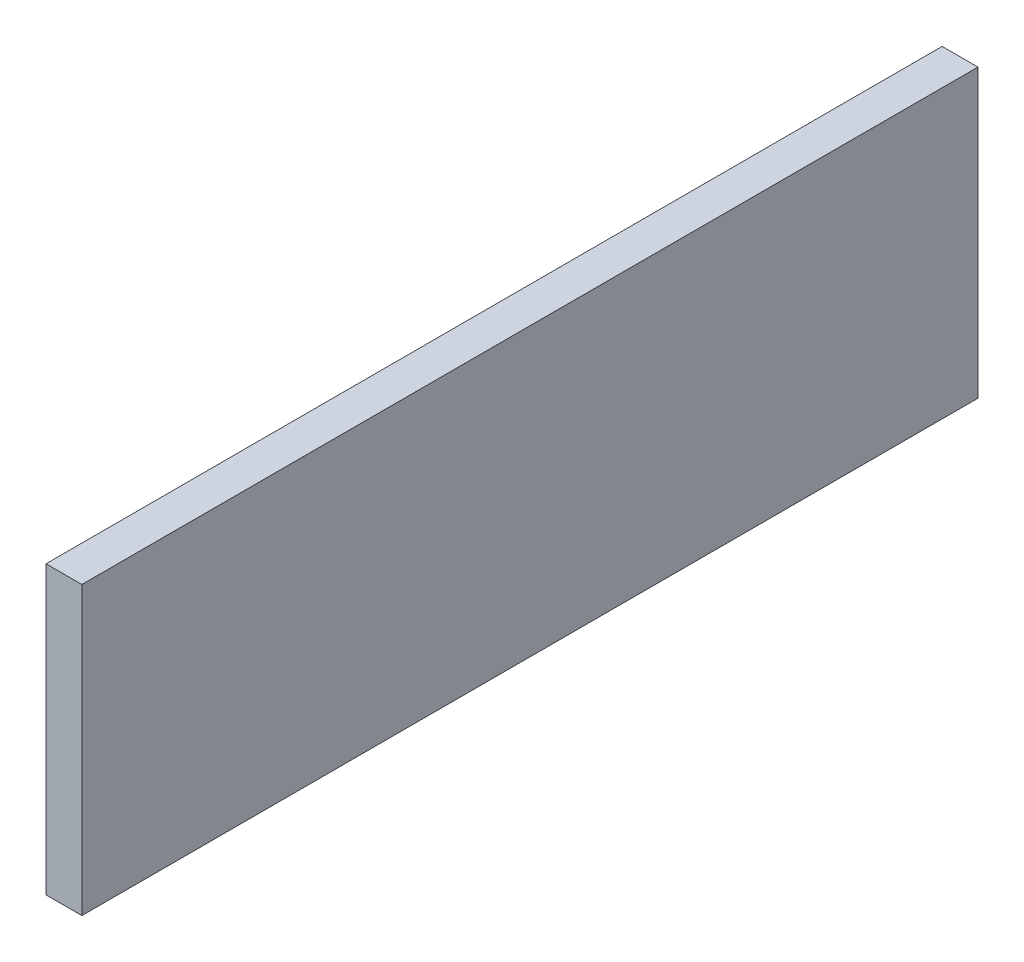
from build123d import *

# Parameters (mm, degrees)
ESQUISSE1_W      = 10
ESQUISSE1_H      = 80
EXTRUSION1_DEPTH = 250


with BuildPart() as part:
    # Esquisse1 → Extrusion1 (new body)
    with BuildSketch(Plane.XY):
        with Locations((5, 40)):
            Rectangle(ESQUISSE1_W, ESQUISSE1_H)
    extrude(amount=EXTRUSION1_DEPTH)


solid = part.part
